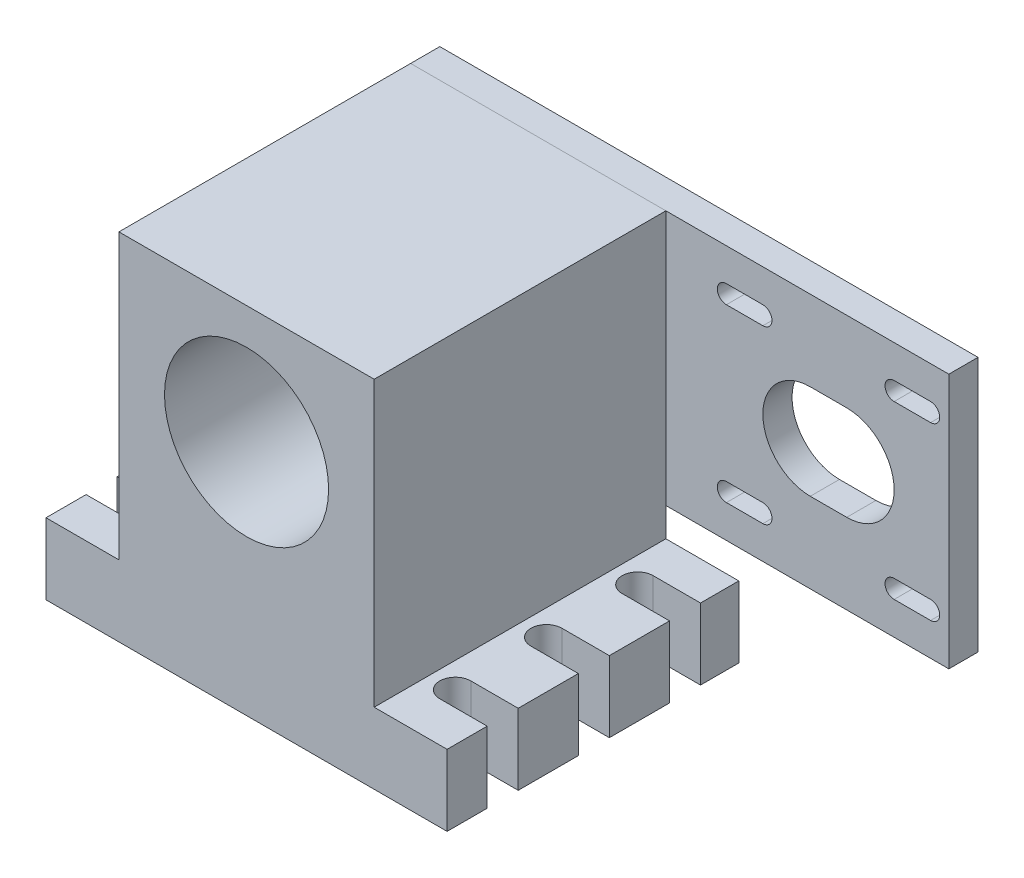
from build123d import *

# Parameters (mm, degrees)
SKETCH1_W           = 110
SKETCH1_H           = 80
BOSS_EXTRUDE1_DEPTH = 19.5
CUT_EXTRUDE1_DEPTH  = 19.5
SKETCH3_W           = 70
SKETCH3_H           = 80
BOSS_EXTRUDE2_DEPTH = 77.9
SKETCH4_R           = 22.5
CUT_EXTRUDE2_DEPTH  = 138.520034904
SKETCH5_W           = 147.6
SKETCH5_H           = 70
BOSS_EXTRUDE3_DEPTH = 8
SKETCH6_R           = 12.5
CUT_EXTRUDE3_DEPTH  = 170.013372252
CUT_EXTRUDE4_DEPTH  = 173.943690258


with BuildPart() as part:
    # Sketch1 → Boss-Extrude1 (new body)
    with BuildSketch(Plane(origin=(0, 0, 0), x_dir=(1, 0, 0), z_dir=(0, 1, 0))):
        Rectangle(SKETCH1_W, SKETCH1_H)
    extrude(amount=BOSS_EXTRUDE1_DEPTH)

    # Sketch2 → Cut-Extrude1 (cut)
    with BuildSketch(Plane(origin=(0, 19.5, 0), x_dir=(1, 0, 0), z_dir=(0, 1, 0))):
        with BuildLine():
            Line((55, 29.5), (55, 21))
            Line((55, 21), (42, 21))
            ThreePointArc((42, 21), (37.75, 25.25), (42, 29.5))
            Line((42, 29.5), (55, 29.5))
        make_face()
        with BuildLine():
            Line((42, 4.5), (55, 4.5))
            Line((55, 4.5), (55, -4))
            Line((55, -4), (42, -4))
            ThreePointArc((42, -4), (37.75, 0.25), (42, 4.5))
        make_face()
        with BuildLine():
            Line((42, -20.5), (55, -20.5))
            Line((55, -20.5), (55, -29))
            Line((55, -29), (42, -29))
            ThreePointArc((42, -29), (37.75, -24.75), (42, -20.5))
        make_face()
        with BuildLine():
            Line((-55, -20.5), (-55, -29))
            Line((-55, -29), (-42, -29))
            ThreePointArc((-42, -29), (-37.75, -24.75), (-42, -20.5))
            Line((-42, -20.5), (-55, -20.5))
        make_face()
        with BuildLine():
            Line((-55, 4.5), (-55, -4))
            Line((-55, -4), (-42, -4))
            ThreePointArc((-42, -4), (-37.75, 0.25), (-42, 4.5))
            Line((-42, 4.5), (-55, 4.5))
        make_face()
        with BuildLine():
            Line((-42, 21), (-55, 21))
            Line((-55, 21), (-55, 29.5))
            Line((-55, 29.5), (-42, 29.5))
            ThreePointArc((-42, 29.5), (-37.75, 25.25), (-42, 21))
        make_face()
    extrude(amount=-CUT_EXTRUDE1_DEPTH, mode=Mode.SUBTRACT)

    # Sketch3 → Boss-Extrude2 (add)
    with BuildSketch(Plane(origin=(0, 19.5, 0), x_dir=(1, 0, 0), z_dir=(0, 1, 0))):
        Rectangle(SKETCH3_W, SKETCH3_H)
    extrude(amount=BOSS_EXTRUDE2_DEPTH)

    # Sketch4 → Cut-Extrude2 (cut, through all)
    with BuildSketch(Plane.XY.offset(40)):
        with Locations((0, 65)):
            Circle(SKETCH4_R)
    extrude(amount=-CUT_EXTRUDE2_DEPTH, mode=Mode.SUBTRACT)


with BuildPart() as body_2:
    # Sketch5 → Boss-Extrude3 (new body)
    with BuildSketch(Plane(origin=(0, 0, -40), x_dir=(-1, 0, 0), z_dir=(0, 0, -1))):
        with Locations((-38.8, 62.4)):
            Rectangle(SKETCH5_W, SKETCH5_H)
    extrude(amount=BOSS_EXTRUDE3_DEPTH)

    # Sketch6 → Cut-Extrude3 (cut, through all)
    with BuildSketch(Plane.XY.offset(-40)):
        with Locations((0, 65)):
            Circle(SKETCH6_R)
    extrude(amount=-CUT_EXTRUDE3_DEPTH, mode=Mode.SUBTRACT)

    # Sketch7 → Cut-Extrude4 (cut, through all)
    with BuildSketch(Plane(origin=(0, 0, -48), x_dir=(-1, 0, 0), z_dir=(0, 0, -1))):
        with BuildLine():
            Line((-84.6, 75.4), (-74.6, 75.4))
            ThreePointArc((-74.6, 75.4), (-61.6, 62.4), (-74.6, 49.4))
            Line((-74.6, 49.4), (-84.6, 49.4))
            ThreePointArc((-84.6, 49.4), (-97.6, 62.4), (-84.6, 75.4))
        make_face()
        with BuildLine():
            Line((-107.6, 88.4), (-97.6, 88.4))
            ThreePointArc((-97.6, 88.4), (-95.1, 85.9), (-97.6, 83.4))
            Line((-97.6, 83.4), (-107.6, 83.4))
            ThreePointArc((-107.6, 83.4), (-110.1, 85.9), (-107.6, 88.4))
        make_face()
        with BuildLine():
            Line((-61.6, 88.4), (-51.6, 88.4))
            ThreePointArc((-51.6, 88.4), (-49.1, 85.9), (-51.6, 83.4))
            Line((-51.6, 83.4), (-61.6, 83.4))
            ThreePointArc((-61.6, 83.4), (-64.1, 85.9), (-61.6, 88.4))
        make_face()
        with BuildLine():
            Line((-61.6, 41.4), (-51.6, 41.4))
            ThreePointArc((-51.6, 41.4), (-49.1, 38.9), (-51.6, 36.4))
            Line((-51.6, 36.4), (-61.6, 36.4))
            ThreePointArc((-61.6, 36.4), (-64.1, 38.9), (-61.6, 41.4))
        make_face()
        with BuildLine():
            Line((-107.6, 41.4), (-97.6, 41.4))
            ThreePointArc((-97.6, 41.4), (-95.1, 38.9), (-97.6, 36.4))
            Line((-97.6, 36.4), (-107.6, 36.4))
            ThreePointArc((-107.6, 36.4), (-110.1, 38.9), (-107.6, 41.4))
        make_face()
    extrude(amount=-CUT_EXTRUDE4_DEPTH, mode=Mode.SUBTRACT)


solid = Compound([part.part, body_2.part])
